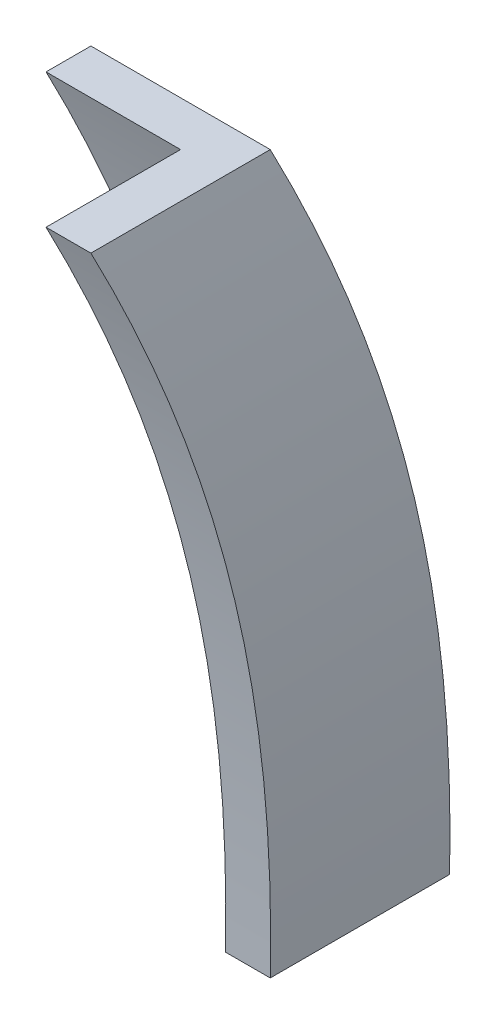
ISO-10303-21;
HEADER;
FILE_DESCRIPTION(('STEP AP214'),'2;1');
FILE_NAME('part.step','',(''),(''),'','','');
FILE_SCHEMA(('AUTOMOTIVE_DESIGN { 1 0 10303 214 1 1 1 1 }'));
ENDSEC;
DATA;
#1=APPLICATION_CONTEXT('core data for automotive mechanical design processes');
#2=APPLICATION_PROTOCOL_DEFINITION('international standard','automotive_design',2000,#1);
#3=PRODUCT_CONTEXT('',#1,'mechanical');
#4=PRODUCT('Part','Part','',(#3));
#5=PRODUCT_RELATED_PRODUCT_CATEGORY('part','',(#4));
#6=PRODUCT_DEFINITION_FORMATION('','',#4);
#7=PRODUCT_DEFINITION_CONTEXT('part definition',#1,'design');
#8=PRODUCT_DEFINITION('design','',#6,#7);
#9=PRODUCT_DEFINITION_SHAPE('','',#8);
#10=(LENGTH_UNIT() NAMED_UNIT(*) SI_UNIT(.MILLI.,.METRE.));
#11=(NAMED_UNIT(*) PLANE_ANGLE_UNIT() SI_UNIT($,.RADIAN.));
#12=(NAMED_UNIT(*) SI_UNIT($,.STERADIAN.) SOLID_ANGLE_UNIT());
#13=UNCERTAINTY_MEASURE_WITH_UNIT(LENGTH_MEASURE(1.E-05),#10,'distance_accuracy_value','');
#14=(GEOMETRIC_REPRESENTATION_CONTEXT(3) GLOBAL_UNCERTAINTY_ASSIGNED_CONTEXT((#13)) GLOBAL_UNIT_ASSIGNED_CONTEXT((#10,
#11,#12)) REPRESENTATION_CONTEXT('',''));
#15=CARTESIAN_POINT('',(0.,0.,0.));
#16=DIRECTION('',(0.,0.,1.));
#17=DIRECTION('',(1.,0.,0.));
#18=AXIS2_PLACEMENT_3D('',#15,#16,#17);
#19=CARTESIAN_POINT('',(0.,0.,0.));
#20=DIRECTION('',(0.,1.,0.));
#21=DIRECTION('',(0.,0.,1.));
#22=AXIS2_PLACEMENT_3D('',#19,#20,#21);
#23=PLANE('',#22);
#24=DIRECTION('',(0.,0.,-1.));
#25=VECTOR('',#24,1.);
#26=CARTESIAN_POINT('',(6.35,0.,-6.35));
#27=LINE('',#26,#25);
#28=CARTESIAN_POINT('',(6.35,0.,6.35));
#29=VERTEX_POINT('',#28);
#30=CARTESIAN_POINT('',(6.35,0.,-6.35));
#31=VERTEX_POINT('',#30);
#32=EDGE_CURVE('E182',#29,#31,#27,.T.);
#33=ORIENTED_EDGE('',*,*,#32,.F.);
#34=DIRECTION('',(1.,0.,0.));
#35=VECTOR('',#34,1.);
#36=CARTESIAN_POINT('',(3.175,0.,6.35));
#37=LINE('',#36,#35);
#38=CARTESIAN_POINT('',(3.175,0.,6.35));
#39=VERTEX_POINT('',#38);
#40=EDGE_CURVE('E329',#39,#29,#37,.T.);
#41=ORIENTED_EDGE('',*,*,#40,.F.);
#42=DIRECTION('',(0.,0.,1.));
#43=VECTOR('',#42,1.);
#44=CARTESIAN_POINT('',(3.175,0.,6.35));
#45=LINE('',#44,#43);
#46=CARTESIAN_POINT('',(3.175,0.,-3.175));
#47=VERTEX_POINT('',#46);
#48=EDGE_CURVE('E456',#47,#39,#45,.T.);
#49=ORIENTED_EDGE('',*,*,#48,.F.);
#50=DIRECTION('',(1.,0.,0.));
#51=VECTOR('',#50,1.);
#52=CARTESIAN_POINT('',(-6.35,0.,-3.175));
#53=LINE('',#52,#51);
#54=CARTESIAN_POINT('',(-6.35,0.,-3.175));
#55=VERTEX_POINT('',#54);
#56=EDGE_CURVE('E463',#55,#47,#53,.T.);
#57=ORIENTED_EDGE('',*,*,#56,.F.);
#58=DIRECTION('',(0.,0.,1.));
#59=VECTOR('',#58,1.);
#60=CARTESIAN_POINT('',(-6.35,0.,-6.35));
#61=LINE('',#60,#59);
#62=CARTESIAN_POINT('',(-6.35,0.,-6.35));
#63=VERTEX_POINT('',#62);
#64=EDGE_CURVE('E127',#63,#55,#61,.T.);
#65=ORIENTED_EDGE('',*,*,#64,.F.);
#66=DIRECTION('',(-1.,0.,0.));
#67=VECTOR('',#66,1.);
#68=CARTESIAN_POINT('',(-6.35,0.,-6.35));
#69=LINE('',#68,#67);
#70=EDGE_CURVE('E13',#31,#63,#69,.T.);
#71=ORIENTED_EDGE('',*,*,#70,.F.);
#72=EDGE_LOOP('',(#33,#41,#49,#57,#65,#71));
#73=FACE_BOUND('',#72,.T.);
#74=ADVANCED_FACE('F117',(#73),#23,.F.);
#75=CARTESIAN_POINT('',(0.,44.45,0.));
#76=DIRECTION('',(0.,-1.,0.));
#77=DIRECTION('',(0.,0.,-1.));
#78=AXIS2_PLACEMENT_3D('',#75,#76,#77);
#79=PLANE('',#78);
#80=DIRECTION('',(0.,0.,-1.));
#81=VECTOR('',#80,1.);
#82=CARTESIAN_POINT('',(0.,44.45,0.));
#83=LINE('',#82,#81);
#84=CARTESIAN_POINT('',(0.,44.45,12.7));
#85=VERTEX_POINT('',#84);
#86=CARTESIAN_POINT('',(0.,44.45,0.));
#87=VERTEX_POINT('',#86);
#88=EDGE_CURVE('E179',#85,#87,#83,.T.);
#89=ORIENTED_EDGE('',*,*,#88,.T.);
#90=DIRECTION('',(-1.,0.,0.));
#91=VECTOR('',#90,1.);
#92=CARTESIAN_POINT('',(0.,44.45,0.));
#93=LINE('',#92,#91);
#94=CARTESIAN_POINT('',(-12.7,44.45,0.));
#95=VERTEX_POINT('',#94);
#96=EDGE_CURVE('E186',#87,#95,#93,.T.);
#97=ORIENTED_EDGE('',*,*,#96,.T.);
#98=DIRECTION('',(0.,0.,1.));
#99=VECTOR('',#98,1.);
#100=CARTESIAN_POINT('',(-12.7,44.45,0.));
#101=LINE('',#100,#99);
#102=CARTESIAN_POINT('',(-12.7,44.45,3.175));
#103=VERTEX_POINT('',#102);
#104=EDGE_CURVE('E192',#95,#103,#101,.T.);
#105=ORIENTED_EDGE('',*,*,#104,.T.);
#106=DIRECTION('',(1.,0.,0.));
#107=VECTOR('',#106,1.);
#108=CARTESIAN_POINT('',(-12.7,44.45,3.175));
#109=LINE('',#108,#107);
#110=CARTESIAN_POINT('',(-3.175,44.45,3.175));
#111=VERTEX_POINT('',#110);
#112=EDGE_CURVE('E255',#103,#111,#109,.T.);
#113=ORIENTED_EDGE('',*,*,#112,.T.);
#114=DIRECTION('',(0.,0.,1.));
#115=VECTOR('',#114,1.);
#116=CARTESIAN_POINT('',(-3.175,44.45,12.7));
#117=LINE('',#116,#115);
#118=CARTESIAN_POINT('',(-3.175,44.45,12.7));
#119=VERTEX_POINT('',#118);
#120=EDGE_CURVE('E254',#111,#119,#117,.T.);
#121=ORIENTED_EDGE('',*,*,#120,.T.);
#122=DIRECTION('',(1.,0.,0.));
#123=VECTOR('',#122,1.);
#124=CARTESIAN_POINT('',(0.,44.45,12.7));
#125=LINE('',#124,#123);
#126=EDGE_CURVE('E198',#119,#85,#125,.T.);
#127=ORIENTED_EDGE('',*,*,#126,.T.);
#128=EDGE_LOOP('',(#89,#97,#105,#113,#121,#127));
#129=FACE_BOUND('',#128,.T.);
#130=ADVANCED_FACE('F196',(#129),#79,.F.);
#131=CARTESIAN_POINT('',(-12.7,44.45,0.));
#132=CARTESIAN_POINT('',(-6.93581719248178,30.5222043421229,-4.5194893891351));
#133=CARTESIAN_POINT('',(-5.83219305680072,15.9951792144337,-6.16220809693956));
#134=CARTESIAN_POINT('',(-6.35,0.,-6.35));
#135=CARTESIAN_POINT('',(-11.6416666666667,44.45,0.));
#136=CARTESIAN_POINT('',(-5.87748385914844,30.5222043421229,-4.5194893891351));
#137=CARTESIAN_POINT('',(-4.77385972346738,15.9951792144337,-6.16220809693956));
#138=CARTESIAN_POINT('',(-5.29166666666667,0.,-6.35));
#139=CARTESIAN_POINT('',(-9.525,44.45,0.));
#140=CARTESIAN_POINT('',(-3.76081719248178,30.5222043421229,-4.5194893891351));
#141=CARTESIAN_POINT('',(-2.65719305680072,15.9951792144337,-6.16220809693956));
#142=CARTESIAN_POINT('',(-3.175,0.,-6.35));
#143=CARTESIAN_POINT('',(-6.35,44.45,0.));
#144=CARTESIAN_POINT('',(-0.585817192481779,30.5222043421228,-4.5194893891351));
#145=CARTESIAN_POINT('',(0.517806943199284,15.9951792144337,-6.16220809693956));
#146=CARTESIAN_POINT('',(0.,0.,-6.34999999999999));
#147=CARTESIAN_POINT('',(-3.175,44.45,0.));
#148=CARTESIAN_POINT('',(2.58918280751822,30.5222043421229,-4.5194893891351));
#149=CARTESIAN_POINT('',(3.69280694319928,15.9951792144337,-6.16220809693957));
#150=CARTESIAN_POINT('',(3.175,0.,-6.35));
#151=CARTESIAN_POINT('',(-1.05833333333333,44.45,0.));
#152=CARTESIAN_POINT('',(4.70584947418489,30.5222043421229,-4.5194893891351));
#153=CARTESIAN_POINT('',(5.80947360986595,15.9951792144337,-6.16220809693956));
#154=CARTESIAN_POINT('',(5.29166666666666,0.,-6.35));
#155=CARTESIAN_POINT('',(0.,44.45,0.));
#156=CARTESIAN_POINT('',(5.76418280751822,30.5222043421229,-4.5194893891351));
#157=CARTESIAN_POINT('',(6.86780694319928,15.9951792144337,-6.16220809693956));
#158=CARTESIAN_POINT('',(6.35,0.,-6.35));
#159=B_SPLINE_SURFACE_WITH_KNOTS('',3,3,((#131,#132,#133,#134),(#135,#136,#137,#138),(#139,#140,
#141,#142),(#143,#144,#145,#146),(#147,#148,#149,#150),(#151,#152,#153,#154),(#155,#156,#157,
#158)),.UNSPECIFIED.,.F.,.F.,.F.,(4,1,1,1,4),(4,4),(0.75,0.8125,0.875,0.9375,1.),(0.,1.),.UNSPECIFIED.);
#160=CARTESIAN_POINT('',(0.,44.45,0.));
#161=CARTESIAN_POINT('',(5.76418280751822,30.5222043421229,-4.5194893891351));
#162=CARTESIAN_POINT('',(6.86780694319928,15.9951792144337,-6.16220809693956));
#163=CARTESIAN_POINT('',(6.35,0.,-6.35));
#164=B_SPLINE_CURVE_WITH_KNOTS('',3,(#160,#161,#162,#163),.UNSPECIFIED.,.F.,.F.,(4,4),(0.,1.),.UNSPECIFIED.);
#165=EDGE_CURVE('E174',#87,#31,#164,.T.);
#166=CARTESIAN_POINT('',(-12.7,44.45,0.));
#167=CARTESIAN_POINT('',(-6.93581719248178,30.5222043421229,-4.5194893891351));
#168=CARTESIAN_POINT('',(-5.83219305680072,15.9951792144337,-6.16220809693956));
#169=CARTESIAN_POINT('',(-6.35,0.,-6.35));
#170=B_SPLINE_CURVE_WITH_KNOTS('',3,(#166,#167,#168,#169),.UNSPECIFIED.,.F.,.F.,(4,4),(0.,1.),.UNSPECIFIED.);
#171=EDGE_CURVE('E142',#95,#63,#170,.T.);
#172=ORIENTED_EDGE('',*,*,#96,.F.);
#173=ORIENTED_EDGE('',*,*,#165,.T.);
#174=ORIENTED_EDGE('',*,*,#70,.T.);
#175=ORIENTED_EDGE('',*,*,#171,.F.);
#176=EDGE_LOOP('',(#172,#173,#174,#175));
#177=FACE_BOUND('',#176,.T.);
#178=ADVANCED_FACE('F188',(#177),#159,.T.);
#179=CARTESIAN_POINT('',(-12.7,44.45,3.175));
#180=CARTESIAN_POINT('',(-6.93581719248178,30.5222043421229,-1.3444893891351));
#181=CARTESIAN_POINT('',(-5.83219305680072,15.9951792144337,-2.98720809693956));
#182=CARTESIAN_POINT('',(-6.35,0.,-3.175));
#183=CARTESIAN_POINT('',(-12.7,44.45,2.91041666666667));
#184=CARTESIAN_POINT('',(-6.93581719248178,30.5222043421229,-1.60907272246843));
#185=CARTESIAN_POINT('',(-5.83219305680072,15.9951792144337,-3.25179143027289));
#186=CARTESIAN_POINT('',(-6.35,0.,-3.43958333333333));
#187=CARTESIAN_POINT('',(-12.7,44.45,2.38125));
#188=CARTESIAN_POINT('',(-6.93581719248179,30.5222043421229,-2.13823938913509));
#189=CARTESIAN_POINT('',(-5.83219305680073,15.9951792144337,-3.78095809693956));
#190=CARTESIAN_POINT('',(-6.35,0.,-3.96874999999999));
#191=CARTESIAN_POINT('',(-12.7,44.45,1.5875));
#192=CARTESIAN_POINT('',(-6.93581719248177,30.5222043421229,-2.9319893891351));
#193=CARTESIAN_POINT('',(-5.83219305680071,15.9951792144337,-4.57470809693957));
#194=CARTESIAN_POINT('',(-6.35,0.,-4.7625));
#195=CARTESIAN_POINT('',(-12.7,44.45,0.793750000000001));
#196=CARTESIAN_POINT('',(-6.93581719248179,30.5222043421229,-3.7257393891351));
#197=CARTESIAN_POINT('',(-5.83219305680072,15.9951792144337,-5.36845809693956));
#198=CARTESIAN_POINT('',(-6.35,0.,-5.55625));
#199=CARTESIAN_POINT('',(-12.7,44.45,0.264583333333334));
#200=CARTESIAN_POINT('',(-6.93581719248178,30.5222043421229,-4.25490605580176));
#201=CARTESIAN_POINT('',(-5.83219305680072,15.9951792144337,-5.89762476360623));
#202=CARTESIAN_POINT('',(-6.35,0.,-6.08541666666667));
#203=CARTESIAN_POINT('',(-12.7,44.45,0.));
#204=CARTESIAN_POINT('',(-6.93581719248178,30.5222043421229,-4.5194893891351));
#205=CARTESIAN_POINT('',(-5.83219305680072,15.9951792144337,-6.16220809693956));
#206=CARTESIAN_POINT('',(-6.35,0.,-6.35));
#207=B_SPLINE_SURFACE_WITH_KNOTS('',3,3,((#179,#180,#181,#182),(#183,#184,#185,#186),(#187,#188,
#189,#190),(#191,#192,#193,#194),(#195,#196,#197,#198),(#199,#200,#201,#202),(#203,#204,#205,
#206)),.UNSPECIFIED.,.F.,.F.,.F.,(4,1,1,1,4),(4,4),(0.6875,0.703125,0.71875,0.734375,0.75),(0.,
1.),.UNSPECIFIED.);
#208=CARTESIAN_POINT('',(-12.7,44.45,3.175));
#209=CARTESIAN_POINT('',(-6.93581719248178,30.5222043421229,-1.3444893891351));
#210=CARTESIAN_POINT('',(-5.83219305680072,15.9951792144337,-2.98720809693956));
#211=CARTESIAN_POINT('',(-6.35,0.,-3.175));
#212=B_SPLINE_CURVE_WITH_KNOTS('',3,(#208,#209,#210,#211),.UNSPECIFIED.,.F.,.F.,(4,4),(0.,1.),.UNSPECIFIED.);
#213=EDGE_CURVE('E390',#103,#55,#212,.T.);
#214=ORIENTED_EDGE('',*,*,#104,.F.);
#215=ORIENTED_EDGE('',*,*,#171,.T.);
#216=ORIENTED_EDGE('',*,*,#64,.T.);
#217=ORIENTED_EDGE('',*,*,#213,.F.);
#218=EDGE_LOOP('',(#214,#215,#216,#217));
#219=FACE_BOUND('',#218,.T.);
#220=ADVANCED_FACE('F272',(#219),#207,.T.);
#221=CARTESIAN_POINT('',(-3.175,44.45,3.175));
#222=CARTESIAN_POINT('',(2.58918280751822,30.5222043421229,-1.3444893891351));
#223=CARTESIAN_POINT('',(3.69280694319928,15.9951792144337,-2.98720809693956));
#224=CARTESIAN_POINT('',(3.175,0.,-3.175));
#225=CARTESIAN_POINT('',(-3.96875,44.45,3.175));
#226=CARTESIAN_POINT('',(1.79543280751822,30.5222043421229,-1.3444893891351));
#227=CARTESIAN_POINT('',(2.89905694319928,15.9951792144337,-2.98720809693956));
#228=CARTESIAN_POINT('',(2.38125,0.,-3.175));
#229=CARTESIAN_POINT('',(-5.55625000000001,44.45,3.175));
#230=CARTESIAN_POINT('',(0.207932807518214,30.5222043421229,-1.3444893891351));
#231=CARTESIAN_POINT('',(1.31155694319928,15.9951792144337,-2.98720809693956));
#232=CARTESIAN_POINT('',(0.793749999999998,0.,-3.175));
#233=CARTESIAN_POINT('',(-7.93749999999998,44.4499999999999,3.175));
#234=CARTESIAN_POINT('',(-2.17331719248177,30.5222043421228,-1.3444893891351));
#235=CARTESIAN_POINT('',(-1.06969305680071,15.9951792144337,-2.98720809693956));
#236=CARTESIAN_POINT('',(-1.5875,0.,-3.175));
#237=CARTESIAN_POINT('',(-10.31875,44.45,3.175));
#238=CARTESIAN_POINT('',(-4.55456719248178,30.5222043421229,-1.34448938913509));
#239=CARTESIAN_POINT('',(-3.45094305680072,15.9951792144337,-2.98720809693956));
#240=CARTESIAN_POINT('',(-3.96875,0.,-3.175));
#241=CARTESIAN_POINT('',(-11.90625,44.45,3.175));
#242=CARTESIAN_POINT('',(-6.14206719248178,30.5222043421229,-1.3444893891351));
#243=CARTESIAN_POINT('',(-5.03844305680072,15.9951792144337,-2.98720809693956));
#244=CARTESIAN_POINT('',(-5.55625,0.,-3.175));
#245=CARTESIAN_POINT('',(-12.7,44.45,3.175));
#246=CARTESIAN_POINT('',(-6.93581719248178,30.5222043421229,-1.3444893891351));
#247=CARTESIAN_POINT('',(-5.83219305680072,15.9951792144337,-2.98720809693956));
#248=CARTESIAN_POINT('',(-6.35,0.,-3.175));
#249=B_SPLINE_SURFACE_WITH_KNOTS('',3,3,((#221,#222,#223,#224),(#225,#226,#227,#228),(#229,#230,
#231,#232),(#233,#234,#235,#236),(#237,#238,#239,#240),(#241,#242,#243,#244),(#245,#246,#247,
#248)),.UNSPECIFIED.,.F.,.F.,.F.,(4,1,1,1,4),(4,4),(0.5,0.546875,0.59375,0.640625,0.6875),(0.,
1.),.UNSPECIFIED.);
#250=CARTESIAN_POINT('',(-3.175,44.45,3.175));
#251=CARTESIAN_POINT('',(2.58918280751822,30.5222043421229,-1.3444893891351));
#252=CARTESIAN_POINT('',(3.69280694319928,15.9951792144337,-2.98720809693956));
#253=CARTESIAN_POINT('',(3.175,0.,-3.175));
#254=B_SPLINE_CURVE_WITH_KNOTS('',3,(#250,#251,#252,#253),.UNSPECIFIED.,.F.,.F.,(4,4),(0.,1.),.UNSPECIFIED.);
#255=EDGE_CURVE('E367',#111,#47,#254,.T.);
#256=ORIENTED_EDGE('',*,*,#112,.F.);
#257=ORIENTED_EDGE('',*,*,#213,.T.);
#258=ORIENTED_EDGE('',*,*,#56,.T.);
#259=ORIENTED_EDGE('',*,*,#255,.F.);
#260=EDGE_LOOP('',(#256,#257,#258,#259));
#261=FACE_BOUND('',#260,.T.);
#262=ADVANCED_FACE('F283',(#261),#249,.T.);
#263=CARTESIAN_POINT('',(-3.175,44.45,12.7));
#264=CARTESIAN_POINT('',(2.58918280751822,30.5222043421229,8.1805106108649));
#265=CARTESIAN_POINT('',(3.69280694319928,15.9951792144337,6.53779190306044));
#266=CARTESIAN_POINT('',(3.175,0.,6.35));
#267=CARTESIAN_POINT('',(-3.175,44.45,11.90625));
#268=CARTESIAN_POINT('',(2.58918280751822,30.5222043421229,7.3867606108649));
#269=CARTESIAN_POINT('',(3.69280694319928,15.9951792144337,5.74404190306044));
#270=CARTESIAN_POINT('',(3.175,0.,5.55625));
#271=CARTESIAN_POINT('',(-3.175,44.45,10.31875));
#272=CARTESIAN_POINT('',(2.58918280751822,30.5222043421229,5.79926061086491));
#273=CARTESIAN_POINT('',(3.69280694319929,15.9951792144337,4.15654190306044));
#274=CARTESIAN_POINT('',(3.17500000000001,0.,3.96875));
#275=CARTESIAN_POINT('',(-3.175,44.4499999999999,7.9375));
#276=CARTESIAN_POINT('',(2.58918280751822,30.5222043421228,3.4180106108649));
#277=CARTESIAN_POINT('',(3.69280694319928,15.9951792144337,1.77529190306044));
#278=CARTESIAN_POINT('',(3.17499999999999,0.,1.5875));
#279=CARTESIAN_POINT('',(-3.175,44.45,5.55625));
#280=CARTESIAN_POINT('',(2.58918280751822,30.5222043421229,1.0367606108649));
#281=CARTESIAN_POINT('',(3.69280694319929,15.9951792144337,-0.605958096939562));
#282=CARTESIAN_POINT('',(3.175,0.,-0.793749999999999));
#283=CARTESIAN_POINT('',(-3.175,44.45,3.96875));
#284=CARTESIAN_POINT('',(2.58918280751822,30.5222043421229,-0.550739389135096));
#285=CARTESIAN_POINT('',(3.69280694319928,15.9951792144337,-2.19345809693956));
#286=CARTESIAN_POINT('',(3.175,0.,-2.38125));
#287=CARTESIAN_POINT('',(-3.175,44.45,3.175));
#288=CARTESIAN_POINT('',(2.58918280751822,30.5222043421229,-1.3444893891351));
#289=CARTESIAN_POINT('',(3.69280694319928,15.9951792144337,-2.98720809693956));
#290=CARTESIAN_POINT('',(3.175,0.,-3.175));
#291=B_SPLINE_SURFACE_WITH_KNOTS('',3,3,((#263,#264,#265,#266),(#267,#268,#269,#270),(#271,#272,
#273,#274),(#275,#276,#277,#278),(#279,#280,#281,#282),(#283,#284,#285,#286),(#287,#288,#289,
#290)),.UNSPECIFIED.,.F.,.F.,.F.,(4,1,1,1,4),(4,4),(0.3125,0.359375,0.40625,0.453125,0.5),(0.,
1.),.UNSPECIFIED.);
#292=CARTESIAN_POINT('',(-3.175,44.45,12.7));
#293=CARTESIAN_POINT('',(2.58918280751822,30.5222043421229,8.1805106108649));
#294=CARTESIAN_POINT('',(3.69280694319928,15.9951792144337,6.53779190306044));
#295=CARTESIAN_POINT('',(3.175,0.,6.35));
#296=B_SPLINE_CURVE_WITH_KNOTS('',3,(#292,#293,#294,#295),.UNSPECIFIED.,.F.,.F.,(4,4),(0.,1.),.UNSPECIFIED.);
#297=EDGE_CURVE('E360',#119,#39,#296,.T.);
#298=ORIENTED_EDGE('',*,*,#120,.F.);
#299=ORIENTED_EDGE('',*,*,#255,.T.);
#300=ORIENTED_EDGE('',*,*,#48,.T.);
#301=ORIENTED_EDGE('',*,*,#297,.F.);
#302=EDGE_LOOP('',(#298,#299,#300,#301));
#303=FACE_BOUND('',#302,.T.);
#304=ADVANCED_FACE('F344',(#303),#291,.T.);
#305=CARTESIAN_POINT('',(0.,44.45,12.7));
#306=CARTESIAN_POINT('',(5.76418280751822,30.5222043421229,8.1805106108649));
#307=CARTESIAN_POINT('',(6.86780694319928,15.9951792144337,6.53779190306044));
#308=CARTESIAN_POINT('',(6.35,0.,6.35));
#309=CARTESIAN_POINT('',(-0.26458333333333,44.45,12.7));
#310=CARTESIAN_POINT('',(5.49959947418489,30.5222043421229,8.1805106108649));
#311=CARTESIAN_POINT('',(6.60322360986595,15.9951792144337,6.53779190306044));
#312=CARTESIAN_POINT('',(6.08541666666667,0.,6.35));
#313=CARTESIAN_POINT('',(-0.793749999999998,44.4500000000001,12.7));
#314=CARTESIAN_POINT('',(4.97043280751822,30.5222043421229,8.18051061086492));
#315=CARTESIAN_POINT('',(6.07405694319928,15.9951792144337,6.53779190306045));
#316=CARTESIAN_POINT('',(5.55625,0.,6.35));
#317=CARTESIAN_POINT('',(-1.5875,44.4499999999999,12.7));
#318=CARTESIAN_POINT('',(4.17668280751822,30.5222043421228,8.18051061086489));
#319=CARTESIAN_POINT('',(5.28030694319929,15.9951792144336,6.53779190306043));
#320=CARTESIAN_POINT('',(4.7625,0.,6.35));
#321=CARTESIAN_POINT('',(-2.38125,44.4500000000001,12.7));
#322=CARTESIAN_POINT('',(3.38293280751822,30.5222043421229,8.18051061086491));
#323=CARTESIAN_POINT('',(4.48655694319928,15.9951792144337,6.53779190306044));
#324=CARTESIAN_POINT('',(3.96875,0.,6.35));
#325=CARTESIAN_POINT('',(-2.91041666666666,44.45,12.7));
#326=CARTESIAN_POINT('',(2.85376614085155,30.5222043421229,8.1805106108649));
#327=CARTESIAN_POINT('',(3.95739027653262,15.9951792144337,6.53779190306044));
#328=CARTESIAN_POINT('',(3.43958333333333,0.,6.35));
#329=CARTESIAN_POINT('',(-3.175,44.45,12.7));
#330=CARTESIAN_POINT('',(2.58918280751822,30.5222043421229,8.1805106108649));
#331=CARTESIAN_POINT('',(3.69280694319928,15.9951792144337,6.53779190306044));
#332=CARTESIAN_POINT('',(3.175,0.,6.35));
#333=B_SPLINE_SURFACE_WITH_KNOTS('',3,3,((#305,#306,#307,#308),(#309,#310,#311,#312),(#313,#314,
#315,#316),(#317,#318,#319,#320),(#321,#322,#323,#324),(#325,#326,#327,#328),(#329,#330,#331,
#332)),.UNSPECIFIED.,.F.,.F.,.F.,(4,1,1,1,4),(4,4),(0.25,0.265625,0.28125,0.296875,0.3125),(0.,
1.),.UNSPECIFIED.);
#334=CARTESIAN_POINT('',(0.,44.45,12.7));
#335=CARTESIAN_POINT('',(5.76418280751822,30.5222043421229,8.1805106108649));
#336=CARTESIAN_POINT('',(6.86780694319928,15.9951792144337,6.53779190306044));
#337=CARTESIAN_POINT('',(6.35,0.,6.35));
#338=B_SPLINE_CURVE_WITH_KNOTS('',3,(#334,#335,#336,#337),.UNSPECIFIED.,.F.,.F.,(4,4),(0.,1.),.UNSPECIFIED.);
#339=EDGE_CURVE('E191',#85,#29,#338,.T.);
#340=ORIENTED_EDGE('',*,*,#126,.F.);
#341=ORIENTED_EDGE('',*,*,#297,.T.);
#342=ORIENTED_EDGE('',*,*,#40,.T.);
#343=ORIENTED_EDGE('',*,*,#339,.F.);
#344=EDGE_LOOP('',(#340,#341,#342,#343));
#345=FACE_BOUND('',#344,.T.);
#346=ADVANCED_FACE('F334',(#345),#333,.T.);
#347=CARTESIAN_POINT('',(0.,44.45,0.));
#348=CARTESIAN_POINT('',(5.76418280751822,30.5222043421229,-4.5194893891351));
#349=CARTESIAN_POINT('',(6.86780694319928,15.9951792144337,-6.16220809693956));
#350=CARTESIAN_POINT('',(6.35,0.,-6.35));
#351=CARTESIAN_POINT('',(0.,44.45,1.05833333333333));
#352=CARTESIAN_POINT('',(5.76418280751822,30.5222043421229,-3.46115605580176));
#353=CARTESIAN_POINT('',(6.86780694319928,15.9951792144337,-5.10387476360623));
#354=CARTESIAN_POINT('',(6.35,0.,-5.29166666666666));
#355=CARTESIAN_POINT('',(0.,44.4500000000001,3.17500000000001));
#356=CARTESIAN_POINT('',(5.76418280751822,30.5222043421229,-1.34448938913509));
#357=CARTESIAN_POINT('',(6.86780694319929,15.9951792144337,-2.98720809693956));
#358=CARTESIAN_POINT('',(6.35,0.,-3.175));
#359=CARTESIAN_POINT('',(0.,44.4499999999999,6.34999999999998));
#360=CARTESIAN_POINT('',(5.76418280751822,30.5222043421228,1.83051061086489));
#361=CARTESIAN_POINT('',(6.86780694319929,15.9951792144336,0.18779190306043));
#362=CARTESIAN_POINT('',(6.35,0.,0.));
#363=CARTESIAN_POINT('',(0.,44.4500000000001,9.52500000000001));
#364=CARTESIAN_POINT('',(5.76418280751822,30.5222043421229,5.00551061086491));
#365=CARTESIAN_POINT('',(6.86780694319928,15.9951792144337,3.36279190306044));
#366=CARTESIAN_POINT('',(6.35,0.,3.175));
#367=CARTESIAN_POINT('',(0.,44.45,11.6416666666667));
#368=CARTESIAN_POINT('',(5.76418280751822,30.5222043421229,7.12217727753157));
#369=CARTESIAN_POINT('',(6.86780694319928,15.9951792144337,5.4794585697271));
#370=CARTESIAN_POINT('',(6.35,0.,5.29166666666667));
#371=CARTESIAN_POINT('',(0.,44.45,12.7));
#372=CARTESIAN_POINT('',(5.76418280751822,30.5222043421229,8.1805106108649));
#373=CARTESIAN_POINT('',(6.86780694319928,15.9951792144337,6.53779190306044));
#374=CARTESIAN_POINT('',(6.35,0.,6.35));
#375=B_SPLINE_SURFACE_WITH_KNOTS('',3,3,((#347,#348,#349,#350),(#351,#352,#353,#354),(#355,#356,
#357,#358),(#359,#360,#361,#362),(#363,#364,#365,#366),(#367,#368,#369,#370),(#371,#372,#373,
#374)),.UNSPECIFIED.,.F.,.F.,.F.,(4,1,1,1,4),(4,4),(0.,0.0625,0.125,0.1875,0.25),(0.,1.),.UNSPECIFIED.);
#376=ORIENTED_EDGE('',*,*,#88,.F.);
#377=ORIENTED_EDGE('',*,*,#339,.T.);
#378=ORIENTED_EDGE('',*,*,#32,.T.);
#379=ORIENTED_EDGE('',*,*,#165,.F.);
#380=EDGE_LOOP('',(#376,#377,#378,#379));
#381=FACE_BOUND('',#380,.T.);
#382=ADVANCED_FACE('F176',(#381),#375,.T.);
#383=CLOSED_SHELL('',(#74,#130,#178,#220,#262,#304,#346,#382));
#384=MANIFOLD_SOLID_BREP('B2',#383);
#385=ADVANCED_BREP_SHAPE_REPRESENTATION('',(#18,#384),#14);
#386=SHAPE_DEFINITION_REPRESENTATION(#9,#385);
ENDSEC;
END-ISO-10303-21;
